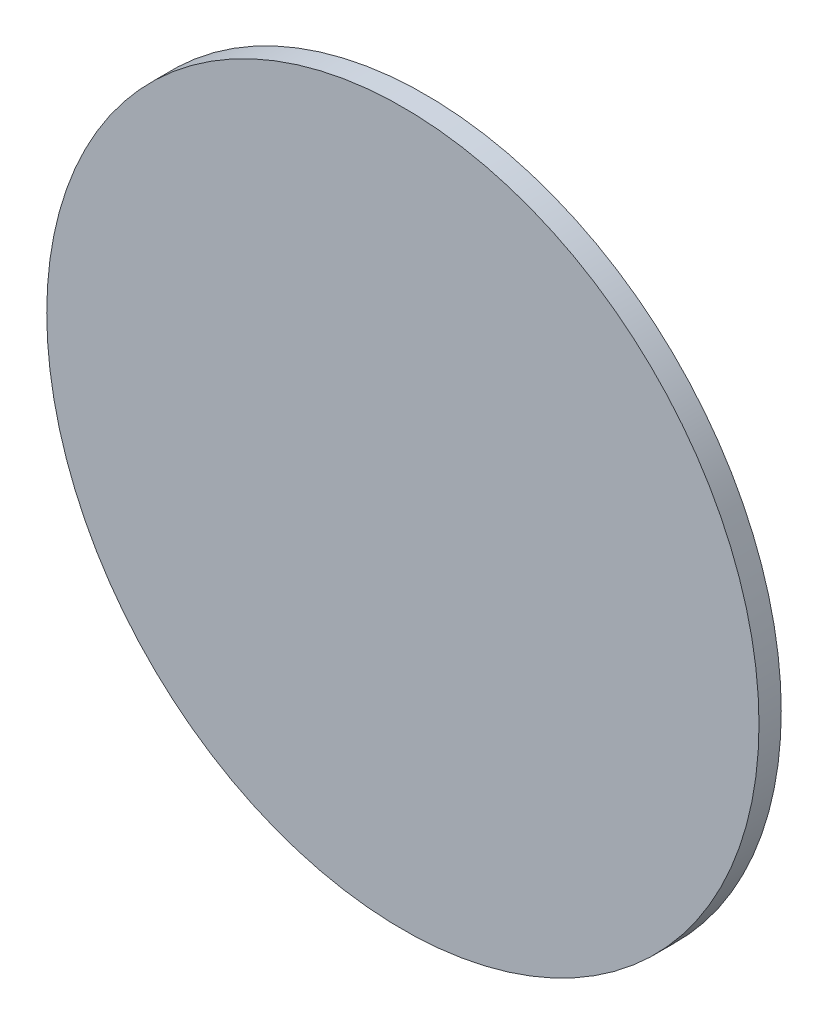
from build123d import *

# Parameters (mm, degrees)
SKETCH1_R      = 16
EXTRUDE1_DEPTH = 1


with BuildPart() as part:
    # Sketch1 → Extrude1 (new body)
    with BuildSketch(Plane.XY):
        Circle(SKETCH1_R)
    extrude(amount=EXTRUDE1_DEPTH)


solid = part.part
